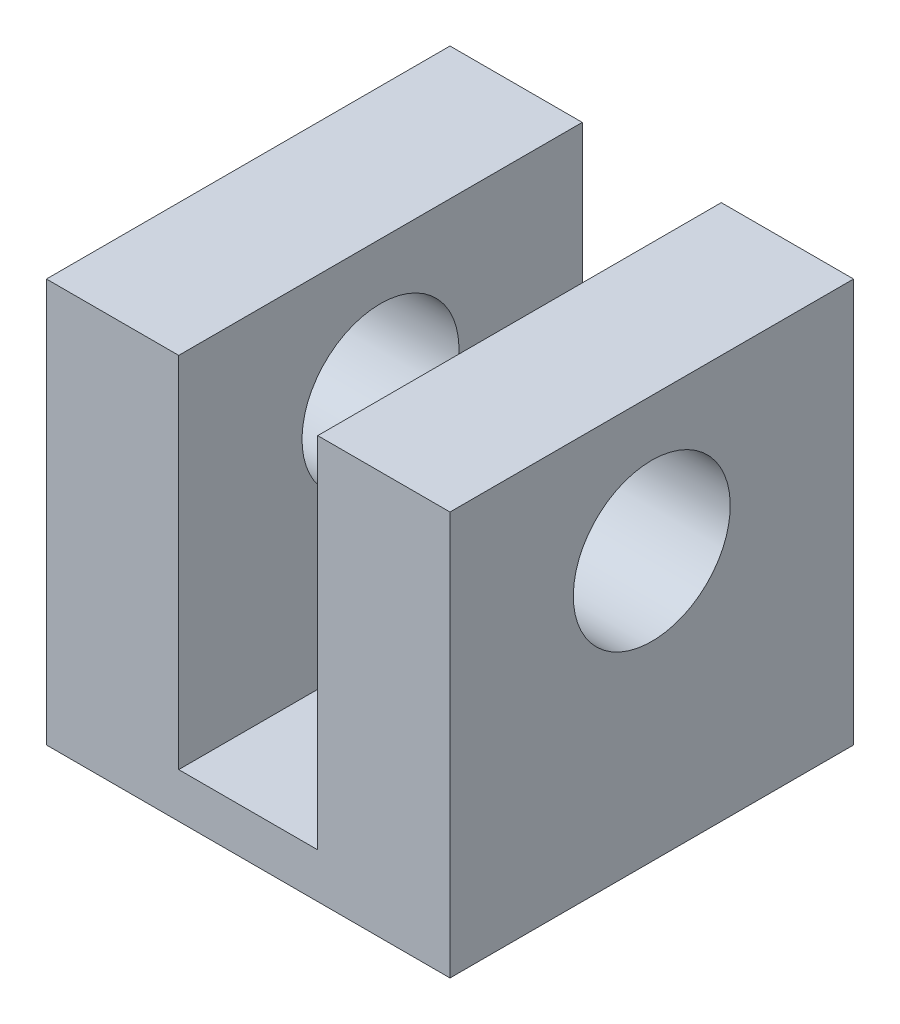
from build123d import *

# Parameters (mm, degrees)
BOSS_EXTRU_1_DEPTH           = 90
ENL_V_MAT_EXTRU_1_DEPTH      = 90
ENL_V_MAT_EXTRU_1_DEPTH_BACK = 90
ESQUISSE2_R                  = 17.5


with BuildPart() as part:
    # Esquisse1 → Boss.-Extru.1 (new body)
    with BuildSketch(Plane.XY):
        Polygon((-45, 90), (-45, 0), (45, 0), (45, 90), (15.5, 90), (15.5, 10), (-15.5, 10), (-15.5, 90), align=None)
    extrude(amount=BOSS_EXTRU_1_DEPTH)

    # Esquisse2 → Enl_v. mat.-Extru.1 (cut, two sides: drawn at the far end of the back side and taken through both)
    with BuildSketch(Plane.ZY.offset(45).offset(-ENL_V_MAT_EXTRU_1_DEPTH_BACK)):
        with Locations(Location((45, 60, 0), (0, 0, 90))):
            Circle(ESQUISSE2_R)
    extrude(amount=ENL_V_MAT_EXTRU_1_DEPTH + ENL_V_MAT_EXTRU_1_DEPTH_BACK, mode=Mode.SUBTRACT)


solid = part.part
